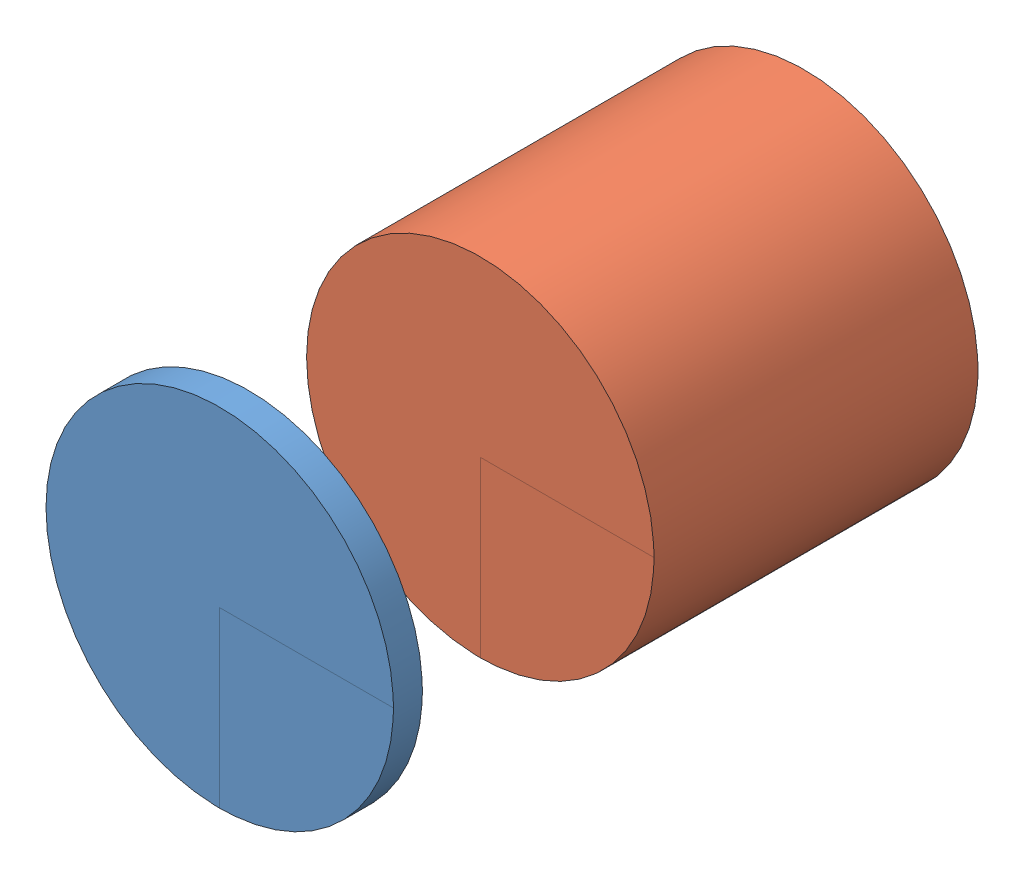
SolidWorks assembly SDOF.SLDASM, configuration Default (file format 4100). Lengths in mm.
Overall size (120 120 201.92).
2 component instances, 2 part files, 3 mates.
Components (placement in the parent):
- base-1: base.SLDPRT [Default] at origin size (120 120 10)
- mass 10kg-1: mass 10kg.SLDPRT [Default] at (0 0 -80) x (1 0 0) z (0 0 -1) size (120 120 111.92)
Mates (geometry in assembly coordinates):
- Concentric1: concentric anti-aligned: cylinder of base-1 through (0 0 10) axis (0 0 -1) radius 60; cylinder of mass 10kg-1 through (0 0 -217.9443) axis (0 0 1) radius 60
- Coincident2: coincident anti-aligned: plane of ? through (0 0 -106.0243) normal (0 -1 0)
- Distance2: distance = 80 mm anti-aligned: plane of mass 10kg-1 through (0 0 -80) normal (0 0 1); plane of base-1 through (0 0 0) normal (0 0 -1)
